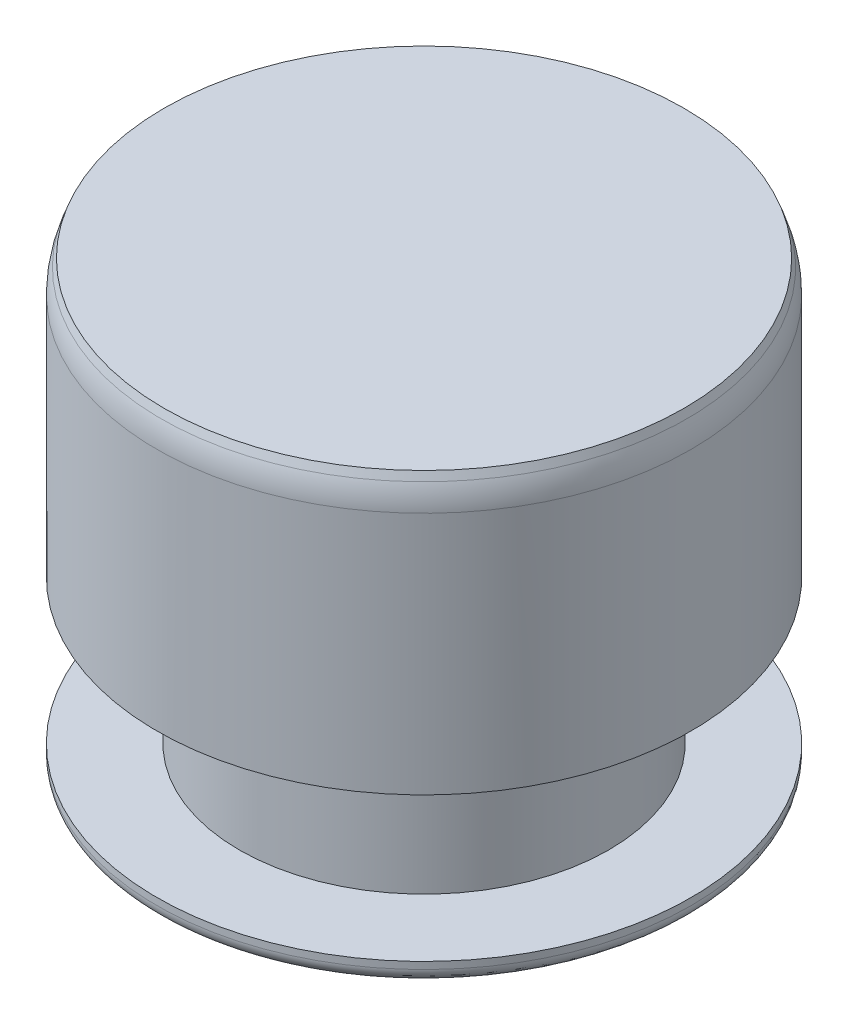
ISO-10303-21;
HEADER;
FILE_DESCRIPTION(('STEP AP214'),'2;1');
FILE_NAME('part.step','',(''),(''),'','','');
FILE_SCHEMA(('AUTOMOTIVE_DESIGN { 1 0 10303 214 1 1 1 1 }'));
ENDSEC;
DATA;
#1=APPLICATION_CONTEXT('core data for automotive mechanical design processes');
#2=APPLICATION_PROTOCOL_DEFINITION('international standard','automotive_design',2000,#1);
#3=PRODUCT_CONTEXT('',#1,'mechanical');
#4=PRODUCT('Part','Part','',(#3));
#5=PRODUCT_RELATED_PRODUCT_CATEGORY('part','',(#4));
#6=PRODUCT_DEFINITION_FORMATION('','',#4);
#7=PRODUCT_DEFINITION_CONTEXT('part definition',#1,'design');
#8=PRODUCT_DEFINITION('design','',#6,#7);
#9=PRODUCT_DEFINITION_SHAPE('','',#8);
#10=(LENGTH_UNIT() NAMED_UNIT(*) SI_UNIT(.MILLI.,.METRE.));
#11=(NAMED_UNIT(*) PLANE_ANGLE_UNIT() SI_UNIT($,.RADIAN.));
#12=(NAMED_UNIT(*) SI_UNIT($,.STERADIAN.) SOLID_ANGLE_UNIT());
#13=UNCERTAINTY_MEASURE_WITH_UNIT(LENGTH_MEASURE(1.E-05),#10,'distance_accuracy_value','');
#14=(GEOMETRIC_REPRESENTATION_CONTEXT(3) GLOBAL_UNCERTAINTY_ASSIGNED_CONTEXT((#13)) GLOBAL_UNIT_ASSIGNED_CONTEXT((#10,
#11,#12)) REPRESENTATION_CONTEXT('',''));
#15=CARTESIAN_POINT('',(0.,0.,0.));
#16=DIRECTION('',(0.,0.,1.));
#17=DIRECTION('',(1.,0.,0.));
#18=AXIS2_PLACEMENT_3D('',#15,#16,#17);
#19=CARTESIAN_POINT('',(3.66,0.,0.));
#20=DIRECTION('',(0.,-1.,0.));
#21=DIRECTION('',(1.,0.,0.));
#22=AXIS2_PLACEMENT_3D('',#19,#20,#21);
#23=PLANE('',#22);
#24=CARTESIAN_POINT('',(0.,0.,0.));
#25=DIRECTION('',(0.,1.,0.));
#26=DIRECTION('',(-1.,0.,0.));
#27=AXIS2_PLACEMENT_3D('',#24,#25,#26);
#28=CIRCLE('',#27,3.66);
#29=CARTESIAN_POINT('',(-3.66,0.,0.));
#30=VERTEX_POINT('',#29);
#31=EDGE_CURVE('E69',#30,#30,#28,.T.);
#32=ORIENTED_EDGE('',*,*,#31,.T.);
#33=EDGE_LOOP('',(#32));
#34=FACE_BOUND('',#33,.T.);
#35=ADVANCED_FACE('F34',(#34),#23,.F.);
#36=CARTESIAN_POINT('',(0.500000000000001,-8.01132486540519,0.));
#37=DIRECTION('',(0.,1.,0.));
#38=DIRECTION('',(-1.,0.,0.));
#39=AXIS2_PLACEMENT_3D('',#36,#37,#38);
#40=PLANE('',#39);
#41=CARTESIAN_POINT('',(0.,-8.01132486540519,0.));
#42=DIRECTION('',(0.,1.,0.));
#43=DIRECTION('',(-1.,0.,0.));
#44=AXIS2_PLACEMENT_3D('',#41,#42,#43);
#45=CIRCLE('',#44,0.5);
#46=CARTESIAN_POINT('',(-0.499999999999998,-8.01132486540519,0.));
#47=VERTEX_POINT('',#46);
#48=EDGE_CURVE('E54',#47,#47,#45,.T.);
#49=ORIENTED_EDGE('',*,*,#48,.F.);
#50=EDGE_LOOP('',(#49));
#51=FACE_BOUND('',#50,.T.);
#52=ADVANCED_FACE('F87',(#51),#40,.F.);
#53=CARTESIAN_POINT('',(0.,-8.01132486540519,0.));
#54=DIRECTION('',(0.,1.,0.));
#55=DIRECTION('',(-1.,0.,0.));
#56=AXIS2_PLACEMENT_3D('',#53,#54,#55);
#57=CONICAL_SURFACE('',#56,0.5,1.0471975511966);
#58=CARTESIAN_POINT('',(0.,-6.18689801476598,0.));
#59=DIRECTION('',(0.,-1.,0.));
#60=DIRECTION('',(1.,0.,0.));
#61=AXIS2_PLACEMENT_3D('',#58,#59,#60);
#62=CIRCLE('',#61,3.66);
#63=CARTESIAN_POINT('',(-3.66,-6.18689801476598,0.));
#64=VERTEX_POINT('',#63);
#65=EDGE_CURVE('E45',#64,#64,#62,.T.);
#66=CARTESIAN_POINT('',(-3.66,-6.18689801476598,0.));
#67=CARTESIAN_POINT('',(-3.62708333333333,-6.20590246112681,0.));
#68=CARTESIAN_POINT('',(-3.59416666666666,-6.22490690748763,0.));
#69=CARTESIAN_POINT('',(-3.52833333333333,-6.26291580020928,0.));
#70=CARTESIAN_POINT('',(-3.49541666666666,-6.28192024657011,0.));
#71=CARTESIAN_POINT('',(-3.42958333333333,-6.31992913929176,0.));
#72=CARTESIAN_POINT('',(-3.39666666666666,-6.33893358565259,0.));
#73=CARTESIAN_POINT('',(-3.33083333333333,-6.37694247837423,0.));
#74=CARTESIAN_POINT('',(-3.29791666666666,-6.39594692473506,0.));
#75=CARTESIAN_POINT('',(-3.23208333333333,-6.43395581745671,0.));
#76=CARTESIAN_POINT('',(-3.19916666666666,-6.45296026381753,0.));
#77=CARTESIAN_POINT('',(-3.13333333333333,-6.49096915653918,0.));
#78=CARTESIAN_POINT('',(-3.10041666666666,-6.50997360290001,0.));
#79=CARTESIAN_POINT('',(-3.03458333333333,-6.54798249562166,0.));
#80=CARTESIAN_POINT('',(-3.00166666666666,-6.56698694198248,0.));
#81=CARTESIAN_POINT('',(-2.93583333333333,-6.60499583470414,0.));
#82=CARTESIAN_POINT('',(-2.90291666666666,-6.62400028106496,0.));
#83=CARTESIAN_POINT('',(-2.83708333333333,-6.66200917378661,0.));
#84=CARTESIAN_POINT('',(-2.80416666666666,-6.68101362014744,0.));
#85=CARTESIAN_POINT('',(-2.73833333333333,-6.71902251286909,0.));
#86=CARTESIAN_POINT('',(-2.70541666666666,-6.73802695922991,0.));
#87=CARTESIAN_POINT('',(-2.63958333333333,-6.77603585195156,0.));
#88=CARTESIAN_POINT('',(-2.60666666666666,-6.79504029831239,0.));
#89=CARTESIAN_POINT('',(-2.54083333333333,-6.83304919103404,0.));
#90=CARTESIAN_POINT('',(-2.50791666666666,-6.85205363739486,0.));
#91=CARTESIAN_POINT('',(-2.44208333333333,-6.89006253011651,0.));
#92=CARTESIAN_POINT('',(-2.40916666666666,-6.90906697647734,0.));
#93=CARTESIAN_POINT('',(-2.34333333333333,-6.94707586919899,0.));
#94=CARTESIAN_POINT('',(-2.31041666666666,-6.96608031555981,0.));
#95=CARTESIAN_POINT('',(-2.24458333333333,-7.00408920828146,0.));
#96=CARTESIAN_POINT('',(-2.21166666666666,-7.02309365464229,0.));
#97=CARTESIAN_POINT('',(-2.14583333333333,-7.06110254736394,0.));
#98=CARTESIAN_POINT('',(-2.11291666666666,-7.08010699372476,0.));
#99=CARTESIAN_POINT('',(-2.04708333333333,-7.11811588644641,0.));
#100=CARTESIAN_POINT('',(-2.01416666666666,-7.13712033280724,0.));
#101=CARTESIAN_POINT('',(-1.94833333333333,-7.17512922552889,0.));
#102=CARTESIAN_POINT('',(-1.91541666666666,-7.19413367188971,0.));
#103=CARTESIAN_POINT('',(-1.84958333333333,-7.23214256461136,0.));
#104=CARTESIAN_POINT('',(-1.81666666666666,-7.25114701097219,0.));
#105=CARTESIAN_POINT('',(-1.75083333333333,-7.28915590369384,0.));
#106=CARTESIAN_POINT('',(-1.71791666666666,-7.30816035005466,0.));
#107=CARTESIAN_POINT('',(-1.65208333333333,-7.34616924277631,0.));
#108=CARTESIAN_POINT('',(-1.61916666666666,-7.36517368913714,0.));
#109=CARTESIAN_POINT('',(-1.55333333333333,-7.40318258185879,0.));
#110=CARTESIAN_POINT('',(-1.52041666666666,-7.42218702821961,0.));
#111=CARTESIAN_POINT('',(-1.45458333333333,-7.46019592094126,0.));
#112=CARTESIAN_POINT('',(-1.42166666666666,-7.47920036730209,0.));
#113=CARTESIAN_POINT('',(-1.35583333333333,-7.51720926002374,0.));
#114=CARTESIAN_POINT('',(-1.32291666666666,-7.53621370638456,0.));
#115=CARTESIAN_POINT('',(-1.25708333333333,-7.57422259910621,0.));
#116=CARTESIAN_POINT('',(-1.22416666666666,-7.59322704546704,0.));
#117=CARTESIAN_POINT('',(-1.15833333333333,-7.63123593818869,0.));
#118=CARTESIAN_POINT('',(-1.12541666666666,-7.65024038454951,0.));
#119=CARTESIAN_POINT('',(-1.05958333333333,-7.68824927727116,0.));
#120=CARTESIAN_POINT('',(-1.02666666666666,-7.70725372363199,0.));
#121=CARTESIAN_POINT('',(-0.960833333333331,-7.74526261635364,0.));
#122=CARTESIAN_POINT('',(-0.927916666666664,-7.76426706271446,0.));
#123=CARTESIAN_POINT('',(-0.862083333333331,-7.80227595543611,0.));
#124=CARTESIAN_POINT('',(-0.829166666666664,-7.82128040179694,0.));
#125=CARTESIAN_POINT('',(-0.763333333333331,-7.85928929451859,0.));
#126=CARTESIAN_POINT('',(-0.730416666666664,-7.87829374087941,0.));
#127=CARTESIAN_POINT('',(-0.664583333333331,-7.91630263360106,0.));
#128=CARTESIAN_POINT('',(-0.631666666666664,-7.93530707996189,0.));
#129=CARTESIAN_POINT('',(-0.565833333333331,-7.97331597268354,0.));
#130=CARTESIAN_POINT('',(-0.532916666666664,-7.99232041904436,0.));
#131=CARTESIAN_POINT('',(-0.499999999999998,-8.01132486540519,0.));
#132=B_SPLINE_CURVE_WITH_KNOTS('',3,(#66,#67,#68,#69,#70,#71,#72,#73,#74,#75,#76,#77,#78,#79,
#80,#81,#82,#83,#84,#85,#86,#87,#88,#89,#90,#91,#92,#93,#94,#95,#96,#97,#98,#99,#100,#101,#102,
#103,#104,#105,#106,#107,#108,#109,#110,#111,#112,#113,#114,#115,#116,#117,#118,#119,#120,#121,
#122,#123,#124,#125,#126,#127,#128,#129,#130,#131),.UNSPECIFIED.,.F.,.F.,(4,2,2,2,2,2,2,2,2,2,2,
2,2,2,2,2,2,2,2,2,2,2,2,2,2,2,2,2,2,2,2,2,4),(0.,0.114026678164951,0.228053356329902,
0.342080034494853,0.456106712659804,0.570133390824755,0.684160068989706,0.798186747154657,
0.912213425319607,1.02624010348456,1.14026678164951,1.25429345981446,1.36832013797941,
1.48234681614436,1.59637349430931,1.71040017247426,1.82442685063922,1.93845352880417,
2.05248020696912,2.16650688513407,2.28053356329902,2.39456024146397,2.50858691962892,
2.62261359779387,2.73664027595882,2.85066695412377,2.96469363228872,3.07872031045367,
3.19274698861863,3.30677366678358,3.42080034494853,3.53482702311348,3.64885370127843),.UNSPECIFIED.);
#133=EDGE_CURVE('BSEAM92',#64,#47,#132,.T.);
#134=ORIENTED_EDGE('',*,*,#65,.T.);
#135=ORIENTED_EDGE('',*,*,#48,.T.);
#136=ORIENTED_EDGE('',*,*,#133,.T.);
#137=ORIENTED_EDGE('',*,*,#133,.F.);
#138=EDGE_LOOP('',(#134,#136,#135,#137));
#139=FACE_BOUND('',#138,.T.);
#140=ADVANCED_FACE('F92',(#139),#57,.T.);
#141=CARTESIAN_POINT('',(0.,0.,0.));
#142=DIRECTION('',(0.,1.,0.));
#143=DIRECTION('',(-1.,0.,0.));
#144=AXIS2_PLACEMENT_3D('',#141,#142,#143);
#145=CYLINDRICAL_SURFACE('',#144,3.76);
#146=CARTESIAN_POINT('',(0.,-6.01369293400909,0.));
#147=DIRECTION('',(0.,-1.,0.));
#148=DIRECTION('',(1.,0.,0.));
#149=AXIS2_PLACEMENT_3D('',#146,#147,#148);
#150=CIRCLE('',#149,3.76);
#151=CARTESIAN_POINT('',(3.76,-6.01369293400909,0.));
#152=VERTEX_POINT('',#151);
#153=EDGE_CURVE('E49',#152,#152,#150,.F.);
#154=ORIENTED_EDGE('',*,*,#153,.T.);
#155=EDGE_LOOP('',(#154));
#156=FACE_BOUND('',#155,.T.);
#157=CARTESIAN_POINT('',(0.,-5.915,0.));
#158=DIRECTION('',(0.,1.,0.));
#159=DIRECTION('',(-1.,0.,0.));
#160=AXIS2_PLACEMENT_3D('',#157,#158,#159);
#161=CIRCLE('',#160,3.76);
#162=CARTESIAN_POINT('',(-3.76,-5.915,0.));
#163=VERTEX_POINT('',#162);
#164=EDGE_CURVE('E57',#163,#163,#161,.T.);
#165=ORIENTED_EDGE('',*,*,#164,.F.);
#166=EDGE_LOOP('',(#165));
#167=FACE_BOUND('',#166,.T.);
#168=ADVANCED_FACE('F98',(#156,#167),#145,.T.);
#169=CARTESIAN_POINT('',(3.76,-5.915,0.));
#170=DIRECTION('',(0.,-1.,0.));
#171=DIRECTION('',(1.,0.,0.));
#172=AXIS2_PLACEMENT_3D('',#169,#170,#171);
#173=PLANE('',#172);
#174=CARTESIAN_POINT('',(0.,-5.915,0.));
#175=DIRECTION('',(0.,1.,0.));
#176=DIRECTION('',(-1.,0.,0.));
#177=AXIS2_PLACEMENT_3D('',#174,#175,#176);
#178=CIRCLE('',#177,2.6);
#179=CARTESIAN_POINT('',(-2.6,-5.915,0.));
#180=VERTEX_POINT('',#179);
#181=EDGE_CURVE('E60',#180,#180,#178,.T.);
#182=ORIENTED_EDGE('',*,*,#181,.F.);
#183=EDGE_LOOP('',(#182));
#184=FACE_BOUND('',#183,.T.);
#185=ORIENTED_EDGE('',*,*,#164,.T.);
#186=EDGE_LOOP('',(#185));
#187=FACE_BOUND('',#186,.T.);
#188=ADVANCED_FACE('F102',(#184,#187),#173,.F.);
#189=CARTESIAN_POINT('',(0.,0.,0.));
#190=DIRECTION('',(0.,1.,0.));
#191=DIRECTION('',(-1.,0.,0.));
#192=AXIS2_PLACEMENT_3D('',#189,#190,#191);
#193=CYLINDRICAL_SURFACE('',#192,2.6);
#194=CARTESIAN_POINT('',(0.,-3.885,0.));
#195=DIRECTION('',(0.,1.,0.));
#196=DIRECTION('',(-1.,0.,0.));
#197=AXIS2_PLACEMENT_3D('',#194,#195,#196);
#198=CIRCLE('',#197,2.6);
#199=CARTESIAN_POINT('',(-2.6,-3.885,0.));
#200=VERTEX_POINT('',#199);
#201=EDGE_CURVE('E63',#200,#200,#198,.T.);
#202=ORIENTED_EDGE('',*,*,#201,.F.);
#203=EDGE_LOOP('',(#202));
#204=FACE_BOUND('',#203,.T.);
#205=ORIENTED_EDGE('',*,*,#181,.T.);
#206=EDGE_LOOP('',(#205));
#207=FACE_BOUND('',#206,.T.);
#208=ADVANCED_FACE('F106',(#204,#207),#193,.T.);
#209=CARTESIAN_POINT('',(2.6,-3.885,0.));
#210=DIRECTION('',(0.,1.,0.));
#211=DIRECTION('',(-1.,0.,0.));
#212=AXIS2_PLACEMENT_3D('',#209,#210,#211);
#213=PLANE('',#212);
#214=CARTESIAN_POINT('',(0.,-3.885,0.));
#215=DIRECTION('',(0.,1.,0.));
#216=DIRECTION('',(-1.,0.,0.));
#217=AXIS2_PLACEMENT_3D('',#214,#215,#216);
#218=CIRCLE('',#217,3.76);
#219=CARTESIAN_POINT('',(-3.76,-3.885,0.));
#220=VERTEX_POINT('',#219);
#221=EDGE_CURVE('E66',#220,#220,#218,.T.);
#222=ORIENTED_EDGE('',*,*,#221,.F.);
#223=EDGE_LOOP('',(#222));
#224=FACE_BOUND('',#223,.T.);
#225=ORIENTED_EDGE('',*,*,#201,.T.);
#226=EDGE_LOOP('',(#225));
#227=FACE_BOUND('',#226,.T.);
#228=ADVANCED_FACE('F84',(#224,#227),#213,.F.);
#229=CARTESIAN_POINT('',(0.,0.,0.));
#230=DIRECTION('',(0.,1.,0.));
#231=DIRECTION('',(-1.,0.,0.));
#232=AXIS2_PLACEMENT_3D('',#229,#230,#231);
#233=CYLINDRICAL_SURFACE('',#232,3.76);
#234=CARTESIAN_POINT('',(0.,-0.451074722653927,0.));
#235=DIRECTION('',(0.,-1.,0.));
#236=DIRECTION('',(1.,0.,0.));
#237=AXIS2_PLACEMENT_3D('',#234,#235,#236);
#238=CIRCLE('',#237,3.76);
#239=CARTESIAN_POINT('',(3.76,-0.451074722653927,0.));
#240=VERTEX_POINT('',#239);
#241=EDGE_CURVE('E10',#240,#240,#238,.T.);
#242=ORIENTED_EDGE('',*,*,#241,.T.);
#243=EDGE_LOOP('',(#242));
#244=FACE_BOUND('',#243,.T.);
#245=ORIENTED_EDGE('',*,*,#221,.T.);
#246=EDGE_LOOP('',(#245));
#247=FACE_BOUND('',#246,.T.);
#248=ADVANCED_FACE('F77',(#244,#247),#233,.T.);
#249=CARTESIAN_POINT('',(0.,-0.274747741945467,0.));
#250=DIRECTION('',(0.,-1.,0.));
#251=DIRECTION('',(1.,0.,0.));
#252=AXIS2_PLACEMENT_3D('',#249,#250,#251);
#253=CONICAL_SURFACE('',#252,3.76,0.34906585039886);
#254=CARTESIAN_POINT('',(0.,-0.109054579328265,0.));
#255=DIRECTION('',(0.,1.,0.));
#256=DIRECTION('',(-1.,0.,0.));
#257=AXIS2_PLACEMENT_3D('',#254,#255,#256);
#258=CIRCLE('',#257,3.69969262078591);
#259=CARTESIAN_POINT('',(-3.69969262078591,-0.109054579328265,0.));
#260=VERTEX_POINT('',#259);
#261=EDGE_CURVE('E41',#260,#260,#258,.T.);
#262=ORIENTED_EDGE('',*,*,#261,.T.);
#263=EDGE_LOOP('',(#262));
#264=FACE_BOUND('',#263,.T.);
#265=ORIENTED_EDGE('',*,*,#31,.F.);
#266=EDGE_LOOP('',(#265));
#267=FACE_BOUND('',#266,.T.);
#268=ADVANCED_FACE('F74',(#264,#267),#253,.T.);
#269=CARTESIAN_POINT('',(0.,-6.01369293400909,0.));
#270=DIRECTION('',(0.,-1.,0.));
#271=DIRECTION('',(1.,0.,0.));
#272=AXIS2_PLACEMENT_3D('',#269,#270,#271);
#273=TOROIDAL_SURFACE('',#272,3.56,0.2);
#274=ORIENTED_EDGE('',*,*,#65,.F.);
#275=EDGE_LOOP('',(#274));
#276=FACE_BOUND('',#275,.T.);
#277=ORIENTED_EDGE('',*,*,#153,.F.);
#278=EDGE_LOOP('',(#277));
#279=FACE_BOUND('',#278,.T.);
#280=ADVANCED_FACE('F76',(#276,#279),#273,.T.);
#281=CARTESIAN_POINT('',(0.,-0.451074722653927,0.));
#282=DIRECTION('',(0.,-1.,0.));
#283=DIRECTION('',(1.,0.,0.));
#284=AXIS2_PLACEMENT_3D('',#281,#282,#283);
#285=TOROIDAL_SURFACE('',#284,2.76,1.);
#286=ORIENTED_EDGE('',*,*,#241,.F.);
#287=EDGE_LOOP('',(#286));
#288=FACE_BOUND('',#287,.T.);
#289=ORIENTED_EDGE('',*,*,#261,.F.);
#290=EDGE_LOOP('',(#289));
#291=FACE_BOUND('',#290,.T.);
#292=ADVANCED_FACE('F36',(#288,#291),#285,.T.);
#293=CLOSED_SHELL('',(#35,#52,#140,#168,#188,#208,#228,#248,#268,#280,#292));
#294=MANIFOLD_SOLID_BREP('B2',#293);
#295=ADVANCED_BREP_SHAPE_REPRESENTATION('',(#18,#294),#14);
#296=SHAPE_DEFINITION_REPRESENTATION(#9,#295);
ENDSEC;
END-ISO-10303-21;
